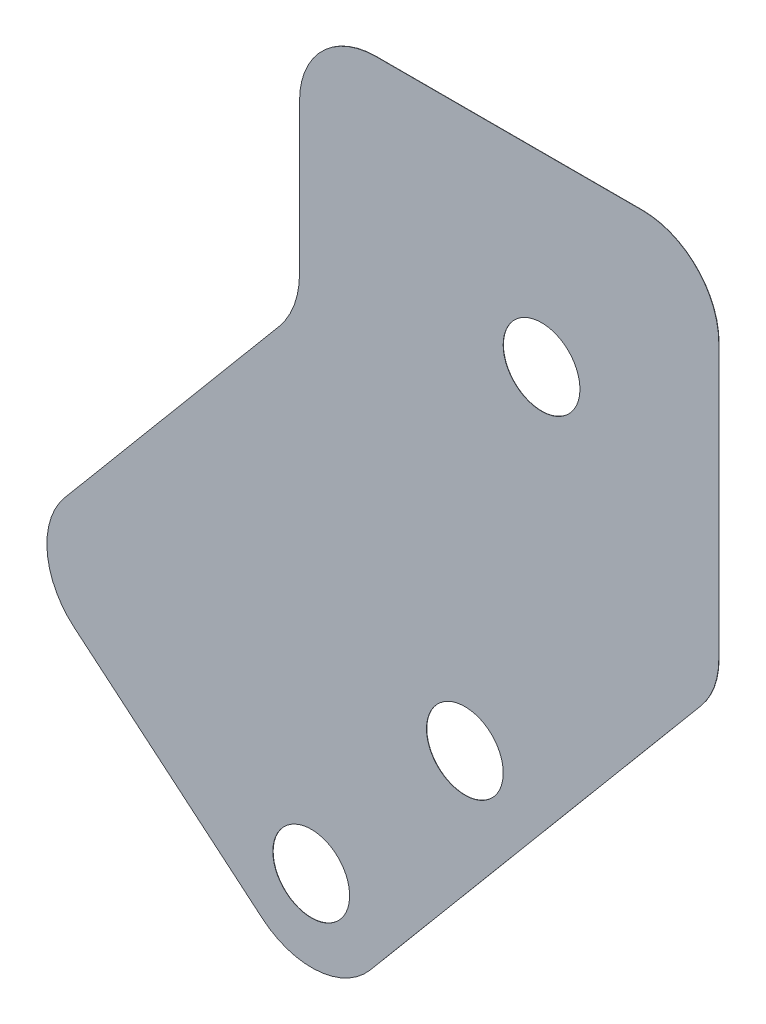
ISO-10303-21;
HEADER;
FILE_DESCRIPTION(('STEP AP214'),'2;1');
FILE_NAME('part.step','',(''),(''),'','','');
FILE_SCHEMA(('AUTOMOTIVE_DESIGN { 1 0 10303 214 1 1 1 1 }'));
ENDSEC;
DATA;
#1=APPLICATION_CONTEXT('core data for automotive mechanical design processes');
#2=APPLICATION_PROTOCOL_DEFINITION('international standard','automotive_design',2000,#1);
#3=PRODUCT_CONTEXT('',#1,'mechanical');
#4=PRODUCT('Part','Part','',(#3));
#5=PRODUCT_RELATED_PRODUCT_CATEGORY('part','',(#4));
#6=PRODUCT_DEFINITION_FORMATION('','',#4);
#7=PRODUCT_DEFINITION_CONTEXT('part definition',#1,'design');
#8=PRODUCT_DEFINITION('design','',#6,#7);
#9=PRODUCT_DEFINITION_SHAPE('','',#8);
#10=(LENGTH_UNIT() NAMED_UNIT(*) SI_UNIT(.MILLI.,.METRE.));
#11=(NAMED_UNIT(*) PLANE_ANGLE_UNIT() SI_UNIT($,.RADIAN.));
#12=(NAMED_UNIT(*) SI_UNIT($,.STERADIAN.) SOLID_ANGLE_UNIT());
#13=UNCERTAINTY_MEASURE_WITH_UNIT(LENGTH_MEASURE(1.E-05),#10,'distance_accuracy_value','');
#14=(GEOMETRIC_REPRESENTATION_CONTEXT(3) GLOBAL_UNCERTAINTY_ASSIGNED_CONTEXT((#13)) GLOBAL_UNIT_ASSIGNED_CONTEXT((#10,
#11,#12)) REPRESENTATION_CONTEXT('',''));
#15=CARTESIAN_POINT('',(0.,0.,0.));
#16=DIRECTION('',(0.,0.,1.));
#17=DIRECTION('',(1.,0.,0.));
#18=AXIS2_PLACEMENT_3D('',#15,#16,#17);
#19=CARTESIAN_POINT('',(-552.951152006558,-20.8198728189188,0.0253999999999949));
#20=DIRECTION('',(0.,0.,-1.));
#21=DIRECTION('',(-1.,0.,0.));
#22=AXIS2_PLACEMENT_3D('',#19,#20,#21);
#23=CYLINDRICAL_SURFACE('',#22,7.11199999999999);
#24=CARTESIAN_POINT('',(-552.951152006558,-20.8198728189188,0.));
#25=DIRECTION('',(0.,0.,1.));
#26=DIRECTION('',(1.,0.,0.));
#27=AXIS2_PLACEMENT_3D('',#24,#25,#26);
#28=CIRCLE('',#27,7.11199999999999);
#29=CARTESIAN_POINT('',(-545.839152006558,-20.8198728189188,0.));
#30=VERTEX_POINT('',#29);
#31=CARTESIAN_POINT('',(-552.951152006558,-13.7078728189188,0.));
#32=VERTEX_POINT('',#31);
#33=EDGE_CURVE('E171',#30,#32,#28,.T.);
#34=ORIENTED_EDGE('',*,*,#33,.T.);
#35=DIRECTION('',(0.,0.,-1.));
#36=VECTOR('',#35,1.);
#37=CARTESIAN_POINT('',(-552.951152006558,-13.7078728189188,0.0253999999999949));
#38=LINE('',#37,#36);
#39=CARTESIAN_POINT('',(-552.951152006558,-13.7078728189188,0.0253999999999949));
#40=VERTEX_POINT('',#39);
#41=EDGE_CURVE('E11',#40,#32,#38,.T.);
#42=ORIENTED_EDGE('',*,*,#41,.F.);
#43=CARTESIAN_POINT('',(-552.951152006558,-20.8198728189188,0.0253999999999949));
#44=DIRECTION('',(0.,0.,1.));
#45=DIRECTION('',(1.,0.,0.));
#46=AXIS2_PLACEMENT_3D('',#43,#44,#45);
#47=CIRCLE('',#46,7.11199999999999);
#48=CARTESIAN_POINT('',(-545.839152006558,-20.8198728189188,0.0253999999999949));
#49=VERTEX_POINT('',#48);
#50=EDGE_CURVE('E206',#49,#40,#47,.T.);
#51=ORIENTED_EDGE('',*,*,#50,.F.);
#52=DIRECTION('',(0.,0.,-1.));
#53=VECTOR('',#52,1.);
#54=CARTESIAN_POINT('',(-545.839152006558,-20.8198728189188,0.0253999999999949));
#55=LINE('',#54,#53);
#56=EDGE_CURVE('E167',#49,#30,#55,.T.);
#57=ORIENTED_EDGE('',*,*,#56,.T.);
#58=EDGE_LOOP('',(#34,#42,#51,#57));
#59=FACE_BOUND('',#58,.T.);
#60=ADVANCED_FACE('F45',(#59),#23,.T.);
#61=CARTESIAN_POINT('',(-552.951152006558,-13.7078728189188,0.0253999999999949));
#62=DIRECTION('',(0.,-1.,0.));
#63=DIRECTION('',(1.,0.,0.));
#64=AXIS2_PLACEMENT_3D('',#61,#62,#63);
#65=PLANE('',#64);
#66=DIRECTION('',(-1.,0.,0.));
#67=VECTOR('',#66,1.);
#68=CARTESIAN_POINT('',(-552.951152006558,-13.7078728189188,0.));
#69=LINE('',#68,#67);
#70=CARTESIAN_POINT('',(-577.716152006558,-13.7078728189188,0.));
#71=VERTEX_POINT('',#70);
#72=EDGE_CURVE('E175',#32,#71,#69,.T.);
#73=ORIENTED_EDGE('',*,*,#72,.T.);
#74=DIRECTION('',(0.,0.,-1.));
#75=VECTOR('',#74,1.);
#76=CARTESIAN_POINT('',(-577.716152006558,-13.7078728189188,0.0253999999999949));
#77=LINE('',#76,#75);
#78=CARTESIAN_POINT('',(-577.716152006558,-13.7078728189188,0.0253999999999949));
#79=VERTEX_POINT('',#78);
#80=EDGE_CURVE('E54',#79,#71,#77,.T.);
#81=ORIENTED_EDGE('',*,*,#80,.F.);
#82=DIRECTION('',(-1.,0.,0.));
#83=VECTOR('',#82,1.);
#84=CARTESIAN_POINT('',(-552.951152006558,-13.7078728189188,0.0253999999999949));
#85=LINE('',#84,#83);
#86=EDGE_CURVE('E117',#40,#79,#85,.T.);
#87=ORIENTED_EDGE('',*,*,#86,.F.);
#88=ORIENTED_EDGE('',*,*,#41,.T.);
#89=EDGE_LOOP('',(#73,#81,#87,#88));
#90=FACE_BOUND('',#89,.T.);
#91=ADVANCED_FACE('F308',(#90),#65,.F.);
#92=CARTESIAN_POINT('',(-577.716152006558,-20.8198728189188,0.0253999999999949));
#93=DIRECTION('',(0.,0.,-1.));
#94=DIRECTION('',(-1.,0.,0.));
#95=AXIS2_PLACEMENT_3D('',#92,#93,#94);
#96=CYLINDRICAL_SURFACE('',#95,7.112);
#97=CARTESIAN_POINT('',(-577.716152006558,-20.8198728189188,0.));
#98=DIRECTION('',(0.,0.,1.));
#99=DIRECTION('',(1.,0.,0.));
#100=AXIS2_PLACEMENT_3D('',#97,#98,#99);
#101=CIRCLE('',#100,7.112);
#102=CARTESIAN_POINT('',(-584.828152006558,-20.8198728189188,0.));
#103=VERTEX_POINT('',#102);
#104=EDGE_CURVE('E179',#71,#103,#101,.T.);
#105=ORIENTED_EDGE('',*,*,#104,.T.);
#106=DIRECTION('',(0.,0.,-1.));
#107=VECTOR('',#106,1.);
#108=CARTESIAN_POINT('',(-584.828152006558,-20.8198728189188,0.0253999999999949));
#109=LINE('',#108,#107);
#110=CARTESIAN_POINT('',(-584.828152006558,-20.8198728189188,0.0253999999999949));
#111=VERTEX_POINT('',#110);
#112=EDGE_CURVE('E233',#111,#103,#109,.T.);
#113=ORIENTED_EDGE('',*,*,#112,.F.);
#114=CARTESIAN_POINT('',(-577.716152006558,-20.8198728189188,0.0253999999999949));
#115=DIRECTION('',(0.,0.,1.));
#116=DIRECTION('',(1.,0.,0.));
#117=AXIS2_PLACEMENT_3D('',#114,#115,#116);
#118=CIRCLE('',#117,7.112);
#119=EDGE_CURVE('E244',#79,#111,#118,.T.);
#120=ORIENTED_EDGE('',*,*,#119,.F.);
#121=ORIENTED_EDGE('',*,*,#80,.T.);
#122=EDGE_LOOP('',(#105,#113,#120,#121));
#123=FACE_BOUND('',#122,.T.);
#124=ADVANCED_FACE('F242',(#123),#96,.T.);
#125=CARTESIAN_POINT('',(-584.828152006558,-20.8198728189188,0.0253999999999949));
#126=DIRECTION('',(1.,0.,0.));
#127=DIRECTION('',(0.,0.,-1.));
#128=AXIS2_PLACEMENT_3D('',#125,#126,#127);
#129=PLANE('',#128);
#130=DIRECTION('',(0.,-1.,0.));
#131=VECTOR('',#130,1.);
#132=CARTESIAN_POINT('',(-584.828152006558,-20.8198728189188,0.));
#133=LINE('',#132,#131);
#134=CARTESIAN_POINT('',(-584.828152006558,-34.722664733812,0.));
#135=VERTEX_POINT('',#134);
#136=EDGE_CURVE('E182',#103,#135,#133,.T.);
#137=ORIENTED_EDGE('',*,*,#136,.T.);
#138=DIRECTION('',(0.,0.,-1.));
#139=VECTOR('',#138,1.);
#140=CARTESIAN_POINT('',(-584.828152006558,-34.722664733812,0.0253999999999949));
#141=LINE('',#140,#139);
#142=CARTESIAN_POINT('',(-584.828152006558,-34.722664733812,0.0253999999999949));
#143=VERTEX_POINT('',#142);
#144=EDGE_CURVE('E229',#143,#135,#141,.T.);
#145=ORIENTED_EDGE('',*,*,#144,.F.);
#146=DIRECTION('',(0.,-1.,0.));
#147=VECTOR('',#146,1.);
#148=CARTESIAN_POINT('',(-584.828152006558,-20.8198728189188,0.0253999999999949));
#149=LINE('',#148,#147);
#150=EDGE_CURVE('E263',#111,#143,#149,.T.);
#151=ORIENTED_EDGE('',*,*,#150,.F.);
#152=ORIENTED_EDGE('',*,*,#112,.T.);
#153=EDGE_LOOP('',(#137,#145,#151,#152));
#154=FACE_BOUND('',#153,.T.);
#155=ADVANCED_FACE('F253',(#154),#129,.F.);
#156=CARTESIAN_POINT('',(-592.956152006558,-34.722664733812,0.0253999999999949));
#157=DIRECTION('',(0.,0.,-1.));
#158=DIRECTION('',(-1.,0.,0.));
#159=AXIS2_PLACEMENT_3D('',#156,#157,#158);
#160=CYLINDRICAL_SURFACE('',#159,8.12799999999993);
#161=CARTESIAN_POINT('',(-592.956152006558,-34.722664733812,0.));
#162=DIRECTION('',(0.,0.,-1.));
#163=DIRECTION('',(1.,0.,0.));
#164=AXIS2_PLACEMENT_3D('',#161,#162,#163);
#165=CIRCLE('',#164,8.12799999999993);
#166=CARTESIAN_POINT('',(-586.729742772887,-39.9472424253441,0.));
#167=VERTEX_POINT('',#166);
#168=EDGE_CURVE('E185',#135,#167,#165,.T.);
#169=ORIENTED_EDGE('',*,*,#168,.T.);
#170=DIRECTION('',(0.,0.,-1.));
#171=VECTOR('',#170,1.);
#172=CARTESIAN_POINT('',(-586.729742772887,-39.9472424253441,0.0253999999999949));
#173=LINE('',#172,#171);
#174=CARTESIAN_POINT('',(-586.729742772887,-39.9472424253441,0.0253999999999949));
#175=VERTEX_POINT('',#174);
#176=EDGE_CURVE('E225',#175,#167,#173,.T.);
#177=ORIENTED_EDGE('',*,*,#176,.F.);
#178=CARTESIAN_POINT('',(-592.956152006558,-34.722664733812,0.0253999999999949));
#179=DIRECTION('',(0.,0.,-1.));
#180=DIRECTION('',(1.,0.,0.));
#181=AXIS2_PLACEMENT_3D('',#178,#179,#180);
#182=CIRCLE('',#181,8.12799999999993);
#183=EDGE_CURVE('E259',#143,#175,#182,.T.);
#184=ORIENTED_EDGE('',*,*,#183,.F.);
#185=ORIENTED_EDGE('',*,*,#144,.T.);
#186=EDGE_LOOP('',(#169,#177,#184,#185));
#187=FACE_BOUND('',#186,.T.);
#188=ADVANCED_FACE('F257',(#187),#160,.F.);
#189=CARTESIAN_POINT('',(-586.729742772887,-39.9472424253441,0.0253999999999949));
#190=DIRECTION('',(0.76604444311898,-0.642787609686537,0.));
#191=DIRECTION('',(0.642787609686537,0.76604444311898,0.));
#192=AXIS2_PLACEMENT_3D('',#189,#190,#191);
#193=PLANE('',#192);
#194=DIRECTION('',(-0.642787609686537,-0.76604444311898,0.));
#195=VECTOR('',#194,1.);
#196=CARTESIAN_POINT('',(-586.729742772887,-39.9472424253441,0.));
#197=LINE('',#196,#195);
#198=CARTESIAN_POINT('',(-606.65926008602,-63.6983162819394,0.));
#199=VERTEX_POINT('',#198);
#200=EDGE_CURVE('E188',#167,#199,#197,.T.);
#201=ORIENTED_EDGE('',*,*,#200,.T.);
#202=DIRECTION('',(0.,0.,-1.));
#203=VECTOR('',#202,1.);
#204=CARTESIAN_POINT('',(-606.65926008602,-63.6983162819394,0.0253999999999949));
#205=LINE('',#204,#203);
#206=CARTESIAN_POINT('',(-606.65926008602,-63.6983162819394,0.0253999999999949));
#207=VERTEX_POINT('',#206);
#208=EDGE_CURVE('E221',#207,#199,#205,.T.);
#209=ORIENTED_EDGE('',*,*,#208,.F.);
#210=DIRECTION('',(-0.642787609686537,-0.76604444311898,0.));
#211=VECTOR('',#210,1.);
#212=CARTESIAN_POINT('',(-586.729742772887,-39.9472424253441,0.0253999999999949));
#213=LINE('',#212,#211);
#214=EDGE_CURVE('E262',#175,#207,#213,.T.);
#215=ORIENTED_EDGE('',*,*,#214,.F.);
#216=ORIENTED_EDGE('',*,*,#176,.T.);
#217=EDGE_LOOP('',(#201,#209,#215,#216));
#218=FACE_BOUND('',#217,.T.);
#219=ADVANCED_FACE('F321',(#218),#193,.F.);
#220=CARTESIAN_POINT('',(-601.211152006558,-68.26982176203,0.0253999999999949));
#221=DIRECTION('',(0.,0.,-1.));
#222=DIRECTION('',(-1.,0.,0.));
#223=AXIS2_PLACEMENT_3D('',#220,#221,#222);
#224=CYLINDRICAL_SURFACE('',#223,7.11200000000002);
#225=CARTESIAN_POINT('',(-601.211152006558,-68.26982176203,0.));
#226=DIRECTION('',(0.,0.,1.));
#227=DIRECTION('',(1.,0.,0.));
#228=AXIS2_PLACEMENT_3D('',#225,#226,#227);
#229=CIRCLE('',#228,7.11200000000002);
#230=CARTESIAN_POINT('',(-605.782657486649,-73.7179298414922,0.));
#231=VERTEX_POINT('',#230);
#232=EDGE_CURVE('E191',#199,#231,#229,.T.);
#233=ORIENTED_EDGE('',*,*,#232,.T.);
#234=DIRECTION('',(0.,0.,-1.));
#235=VECTOR('',#234,1.);
#236=CARTESIAN_POINT('',(-605.782657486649,-73.7179298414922,0.0253999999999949));
#237=LINE('',#236,#235);
#238=CARTESIAN_POINT('',(-605.782657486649,-73.7179298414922,0.0253999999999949));
#239=VERTEX_POINT('',#238);
#240=EDGE_CURVE('E217',#239,#231,#237,.T.);
#241=ORIENTED_EDGE('',*,*,#240,.F.);
#242=CARTESIAN_POINT('',(-601.211152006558,-68.26982176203,0.0253999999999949));
#243=DIRECTION('',(0.,0.,1.));
#244=DIRECTION('',(1.,0.,0.));
#245=AXIS2_PLACEMENT_3D('',#242,#243,#244);
#246=CIRCLE('',#245,7.11200000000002);
#247=EDGE_CURVE('E268',#207,#239,#246,.T.);
#248=ORIENTED_EDGE('',*,*,#247,.F.);
#249=ORIENTED_EDGE('',*,*,#208,.T.);
#250=EDGE_LOOP('',(#233,#241,#248,#249));
#251=FACE_BOUND('',#250,.T.);
#252=ADVANCED_FACE('F324',(#251),#224,.T.);
#253=CARTESIAN_POINT('',(-605.782657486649,-73.7179298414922,0.0253999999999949));
#254=DIRECTION('',(0.642787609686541,0.766044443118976,0.));
#255=DIRECTION('',(-0.766044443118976,0.642787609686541,0.));
#256=AXIS2_PLACEMENT_3D('',#253,#254,#255);
#257=PLANE('',#256);
#258=DIRECTION('',(0.766044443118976,-0.642787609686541,0.));
#259=VECTOR('',#258,1.);
#260=CARTESIAN_POINT('',(-605.782657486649,-73.7179298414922,0.));
#261=LINE('',#260,#259);
#262=CARTESIAN_POINT('',(-588.270881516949,-88.4120545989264,0.));
#263=VERTEX_POINT('',#262);
#264=EDGE_CURVE('E194',#231,#263,#261,.T.);
#265=ORIENTED_EDGE('',*,*,#264,.T.);
#266=DIRECTION('',(0.,0.,-1.));
#267=VECTOR('',#266,1.);
#268=CARTESIAN_POINT('',(-588.270881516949,-88.4120545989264,0.0253999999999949));
#269=LINE('',#268,#267);
#270=CARTESIAN_POINT('',(-588.270881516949,-88.4120545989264,0.0253999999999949));
#271=VERTEX_POINT('',#270);
#272=EDGE_CURVE('E213',#271,#263,#269,.T.);
#273=ORIENTED_EDGE('',*,*,#272,.F.);
#274=DIRECTION('',(0.766044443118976,-0.642787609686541,0.));
#275=VECTOR('',#274,1.);
#276=CARTESIAN_POINT('',(-605.782657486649,-73.7179298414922,0.0253999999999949));
#277=LINE('',#276,#275);
#278=EDGE_CURVE('E275',#239,#271,#277,.T.);
#279=ORIENTED_EDGE('',*,*,#278,.F.);
#280=ORIENTED_EDGE('',*,*,#240,.T.);
#281=EDGE_LOOP('',(#265,#273,#279,#280));
#282=FACE_BOUND('',#281,.T.);
#283=ADVANCED_FACE('F288',(#282),#257,.F.);
#284=CARTESIAN_POINT('',(-583.699376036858,-82.9639465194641,0.0253999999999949));
#285=DIRECTION('',(0.,0.,-1.));
#286=DIRECTION('',(-1.,0.,0.));
#287=AXIS2_PLACEMENT_3D('',#284,#285,#286);
#288=CYLINDRICAL_SURFACE('',#287,7.11200000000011);
#289=CARTESIAN_POINT('',(-583.699376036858,-82.9639465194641,0.));
#290=DIRECTION('',(0.,0.,1.));
#291=DIRECTION('',(1.,0.,0.));
#292=AXIS2_PLACEMENT_3D('',#289,#290,#291);
#293=CIRCLE('',#292,7.11200000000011);
#294=CARTESIAN_POINT('',(-578.251267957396,-87.5354519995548,0.));
#295=VERTEX_POINT('',#294);
#296=EDGE_CURVE('E197',#263,#295,#293,.T.);
#297=ORIENTED_EDGE('',*,*,#296,.T.);
#298=DIRECTION('',(0.,0.,-1.));
#299=VECTOR('',#298,1.);
#300=CARTESIAN_POINT('',(-578.251267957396,-87.5354519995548,0.0253999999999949));
#301=LINE('',#300,#299);
#302=CARTESIAN_POINT('',(-578.251267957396,-87.5354519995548,0.0253999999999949));
#303=VERTEX_POINT('',#302);
#304=EDGE_CURVE('E159',#303,#295,#301,.T.);
#305=ORIENTED_EDGE('',*,*,#304,.F.);
#306=CARTESIAN_POINT('',(-583.699376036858,-82.9639465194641,0.0253999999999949));
#307=DIRECTION('',(0.,0.,1.));
#308=DIRECTION('',(1.,0.,0.));
#309=AXIS2_PLACEMENT_3D('',#306,#307,#308);
#310=CIRCLE('',#309,7.11200000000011);
#311=EDGE_CURVE('E148',#271,#303,#310,.T.);
#312=ORIENTED_EDGE('',*,*,#311,.F.);
#313=ORIENTED_EDGE('',*,*,#272,.T.);
#314=EDGE_LOOP('',(#297,#305,#312,#313));
#315=FACE_BOUND('',#314,.T.);
#316=ADVANCED_FACE('F292',(#315),#288,.T.);
#317=CARTESIAN_POINT('',(-578.251267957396,-87.5354519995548,0.0253999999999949));
#318=DIRECTION('',(-0.766044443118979,0.642787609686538,0.));
#319=DIRECTION('',(-0.642787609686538,-0.766044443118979,0.));
#320=AXIS2_PLACEMENT_3D('',#317,#318,#319);
#321=PLANE('',#320);
#322=DIRECTION('',(0.642787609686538,0.766044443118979,0.));
#323=VECTOR('',#322,1.);
#324=CARTESIAN_POINT('',(-578.251267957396,-87.5354519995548,0.));
#325=LINE('',#324,#323);
#326=CARTESIAN_POINT('',(-547.503043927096,-50.8911455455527,0.));
#327=VERTEX_POINT('',#326);
#328=EDGE_CURVE('E157',#295,#327,#325,.T.);
#329=ORIENTED_EDGE('',*,*,#328,.T.);
#330=DIRECTION('',(0.,0.,-1.));
#331=VECTOR('',#330,1.);
#332=CARTESIAN_POINT('',(-547.503043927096,-50.8911455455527,0.0253999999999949));
#333=LINE('',#332,#331);
#334=CARTESIAN_POINT('',(-547.503043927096,-50.8911455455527,0.0253999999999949));
#335=VERTEX_POINT('',#334);
#336=EDGE_CURVE('E154',#335,#327,#333,.T.);
#337=ORIENTED_EDGE('',*,*,#336,.F.);
#338=DIRECTION('',(0.642787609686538,0.766044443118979,0.));
#339=VECTOR('',#338,1.);
#340=CARTESIAN_POINT('',(-578.251267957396,-87.5354519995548,0.0253999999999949));
#341=LINE('',#340,#339);
#342=EDGE_CURVE('E142',#303,#335,#341,.T.);
#343=ORIENTED_EDGE('',*,*,#342,.F.);
#344=ORIENTED_EDGE('',*,*,#304,.T.);
#345=EDGE_LOOP('',(#329,#337,#343,#344));
#346=FACE_BOUND('',#345,.T.);
#347=ADVANCED_FACE('F155',(#346),#321,.F.);
#348=CARTESIAN_POINT('',(-552.951152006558,-46.319640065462,0.0253999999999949));
#349=DIRECTION('',(0.,0.,-1.));
#350=DIRECTION('',(-1.,0.,0.));
#351=AXIS2_PLACEMENT_3D('',#348,#349,#350);
#352=CYLINDRICAL_SURFACE('',#351,7.11199999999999);
#353=CARTESIAN_POINT('',(-552.951152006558,-46.319640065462,0.));
#354=DIRECTION('',(0.,0.,1.));
#355=DIRECTION('',(1.,0.,0.));
#356=AXIS2_PLACEMENT_3D('',#353,#354,#355);
#357=CIRCLE('',#356,7.11199999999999);
#358=CARTESIAN_POINT('',(-545.839152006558,-46.319640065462,0.));
#359=VERTEX_POINT('',#358);
#360=EDGE_CURVE('E103',#327,#359,#357,.T.);
#361=ORIENTED_EDGE('',*,*,#360,.T.);
#362=DIRECTION('',(0.,0.,-1.));
#363=VECTOR('',#362,1.);
#364=CARTESIAN_POINT('',(-545.839152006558,-46.319640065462,0.0253999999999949));
#365=LINE('',#364,#363);
#366=CARTESIAN_POINT('',(-545.839152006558,-46.319640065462,0.0253999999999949));
#367=VERTEX_POINT('',#366);
#368=EDGE_CURVE('E160',#367,#359,#365,.T.);
#369=ORIENTED_EDGE('',*,*,#368,.F.);
#370=CARTESIAN_POINT('',(-552.951152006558,-46.319640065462,0.0253999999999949));
#371=DIRECTION('',(0.,0.,1.));
#372=DIRECTION('',(1.,0.,0.));
#373=AXIS2_PLACEMENT_3D('',#370,#371,#372);
#374=CIRCLE('',#373,7.11199999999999);
#375=EDGE_CURVE('E146',#335,#367,#374,.T.);
#376=ORIENTED_EDGE('',*,*,#375,.F.);
#377=ORIENTED_EDGE('',*,*,#336,.T.);
#378=EDGE_LOOP('',(#361,#369,#376,#377));
#379=FACE_BOUND('',#378,.T.);
#380=ADVANCED_FACE('F162',(#379),#352,.T.);
#381=CARTESIAN_POINT('',(-545.839152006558,-46.319640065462,0.0253999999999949));
#382=DIRECTION('',(-1.,0.,0.));
#383=DIRECTION('',(0.,0.,1.));
#384=AXIS2_PLACEMENT_3D('',#381,#382,#383);
#385=PLANE('',#384);
#386=DIRECTION('',(0.,1.,0.));
#387=VECTOR('',#386,1.);
#388=CARTESIAN_POINT('',(-545.839152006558,-46.319640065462,0.));
#389=LINE('',#388,#387);
#390=EDGE_CURVE('E109',#359,#30,#389,.T.);
#391=ORIENTED_EDGE('',*,*,#390,.T.);
#392=ORIENTED_EDGE('',*,*,#56,.F.);
#393=DIRECTION('',(0.,1.,0.));
#394=VECTOR('',#393,1.);
#395=CARTESIAN_POINT('',(-545.839152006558,-46.319640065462,0.0253999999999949));
#396=LINE('',#395,#394);
#397=EDGE_CURVE('E62',#367,#49,#396,.T.);
#398=ORIENTED_EDGE('',*,*,#397,.F.);
#399=ORIENTED_EDGE('',*,*,#368,.T.);
#400=EDGE_LOOP('',(#391,#392,#398,#399));
#401=FACE_BOUND('',#400,.T.);
#402=ADVANCED_FACE('F296',(#401),#385,.F.);
#403=CARTESIAN_POINT('',(-552.951152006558,-20.8198728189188,0.0253999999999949));
#404=DIRECTION('',(0.,0.,1.));
#405=DIRECTION('',(1.,0.,0.));
#406=AXIS2_PLACEMENT_3D('',#403,#404,#405);
#407=PLANE('',#406);
#408=CARTESIAN_POINT('',(-583.738510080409,-82.5166423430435,0.0253999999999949));
#409=DIRECTION('',(0.,0.,-1.));
#410=DIRECTION('',(-1.,0.,0.));
#411=AXIS2_PLACEMENT_3D('',#408,#409,#410);
#412=CIRCLE('',#411,3.56869999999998);
#413=CARTESIAN_POINT('',(-587.307210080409,-82.5166423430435,0.0253999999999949));
#414=VERTEX_POINT('',#413);
#415=EDGE_CURVE('E404',#414,#414,#412,.T.);
#416=ORIENTED_EDGE('',*,*,#415,.T.);
#417=EDGE_LOOP('',(#416));
#418=FACE_BOUND('',#417,.T.);
#419=CARTESIAN_POINT('',(-562.323795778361,-31.0085922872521,0.0253999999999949));
#420=DIRECTION('',(0.,0.,-1.));
#421=DIRECTION('',(-1.,0.,0.));
#422=AXIS2_PLACEMENT_3D('',#419,#420,#421);
#423=CIRCLE('',#422,3.56869999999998);
#424=CARTESIAN_POINT('',(-565.892495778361,-31.0085922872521,0.0253999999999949));
#425=VERTEX_POINT('',#424);
#426=EDGE_CURVE('E409',#425,#425,#423,.T.);
#427=ORIENTED_EDGE('',*,*,#426,.T.);
#428=EDGE_LOOP('',(#427));
#429=FACE_BOUND('',#428,.T.);
#430=CARTESIAN_POINT('',(-569.452555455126,-65.4913045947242,0.0253999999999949));
#431=DIRECTION('',(0.,0.,-1.));
#432=DIRECTION('',(-1.,0.,0.));
#433=AXIS2_PLACEMENT_3D('',#430,#431,#432);
#434=CIRCLE('',#433,3.56869999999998);
#435=CARTESIAN_POINT('',(-573.021255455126,-65.4913045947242,0.0253999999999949));
#436=VERTEX_POINT('',#435);
#437=EDGE_CURVE('E422',#436,#436,#434,.T.);
#438=ORIENTED_EDGE('',*,*,#437,.T.);
#439=EDGE_LOOP('',(#438));
#440=FACE_BOUND('',#439,.T.);
#441=ORIENTED_EDGE('',*,*,#50,.T.);
#442=ORIENTED_EDGE('',*,*,#86,.T.);
#443=ORIENTED_EDGE('',*,*,#119,.T.);
#444=ORIENTED_EDGE('',*,*,#150,.T.);
#445=ORIENTED_EDGE('',*,*,#183,.T.);
#446=ORIENTED_EDGE('',*,*,#214,.T.);
#447=ORIENTED_EDGE('',*,*,#247,.T.);
#448=ORIENTED_EDGE('',*,*,#278,.T.);
#449=ORIENTED_EDGE('',*,*,#311,.T.);
#450=ORIENTED_EDGE('',*,*,#342,.T.);
#451=ORIENTED_EDGE('',*,*,#375,.T.);
#452=ORIENTED_EDGE('',*,*,#397,.T.);
#453=EDGE_LOOP('',(#441,#442,#443,#444,#445,#446,#447,#448,#449,#450,#451,#452));
#454=FACE_BOUND('',#453,.T.);
#455=ADVANCED_FACE('F144',(#418,#429,#440,#454),#407,.T.);
#456=CARTESIAN_POINT('',(-552.951152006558,-20.8198728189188,0.));
#457=DIRECTION('',(0.,0.,1.));
#458=DIRECTION('',(1.,0.,0.));
#459=AXIS2_PLACEMENT_3D('',#456,#457,#458);
#460=PLANE('',#459);
#461=CARTESIAN_POINT('',(-583.738510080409,-82.5166423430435,0.));
#462=DIRECTION('',(0.,0.,-1.));
#463=DIRECTION('',(-1.,0.,0.));
#464=AXIS2_PLACEMENT_3D('',#461,#462,#463);
#465=CIRCLE('',#464,3.56869999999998);
#466=CARTESIAN_POINT('',(-587.307210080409,-82.5166423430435,0.));
#467=VERTEX_POINT('',#466);
#468=EDGE_CURVE('E407',#467,#467,#465,.T.);
#469=ORIENTED_EDGE('',*,*,#468,.F.);
#470=EDGE_LOOP('',(#469));
#471=FACE_BOUND('',#470,.T.);
#472=CARTESIAN_POINT('',(-562.323795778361,-31.0085922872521,0.));
#473=DIRECTION('',(0.,0.,-1.));
#474=DIRECTION('',(-1.,0.,0.));
#475=AXIS2_PLACEMENT_3D('',#472,#473,#474);
#476=CIRCLE('',#475,3.56869999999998);
#477=CARTESIAN_POINT('',(-565.892495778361,-31.0085922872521,0.));
#478=VERTEX_POINT('',#477);
#479=EDGE_CURVE('E415',#478,#478,#476,.T.);
#480=ORIENTED_EDGE('',*,*,#479,.F.);
#481=EDGE_LOOP('',(#480));
#482=FACE_BOUND('',#481,.T.);
#483=CARTESIAN_POINT('',(-569.452555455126,-65.4913045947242,0.));
#484=DIRECTION('',(0.,0.,-1.));
#485=DIRECTION('',(-1.,0.,0.));
#486=AXIS2_PLACEMENT_3D('',#483,#484,#485);
#487=CIRCLE('',#486,3.56869999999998);
#488=CARTESIAN_POINT('',(-573.021255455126,-65.4913045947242,0.));
#489=VERTEX_POINT('',#488);
#490=EDGE_CURVE('E176',#489,#489,#487,.T.);
#491=ORIENTED_EDGE('',*,*,#490,.F.);
#492=EDGE_LOOP('',(#491));
#493=FACE_BOUND('',#492,.T.);
#494=ORIENTED_EDGE('',*,*,#33,.F.);
#495=ORIENTED_EDGE('',*,*,#390,.F.);
#496=ORIENTED_EDGE('',*,*,#360,.F.);
#497=ORIENTED_EDGE('',*,*,#328,.F.);
#498=ORIENTED_EDGE('',*,*,#296,.F.);
#499=ORIENTED_EDGE('',*,*,#264,.F.);
#500=ORIENTED_EDGE('',*,*,#232,.F.);
#501=ORIENTED_EDGE('',*,*,#200,.F.);
#502=ORIENTED_EDGE('',*,*,#168,.F.);
#503=ORIENTED_EDGE('',*,*,#136,.F.);
#504=ORIENTED_EDGE('',*,*,#104,.F.);
#505=ORIENTED_EDGE('',*,*,#72,.F.);
#506=EDGE_LOOP('',(#494,#495,#496,#497,#498,#499,#500,#501,#502,#503,#504,#505));
#507=FACE_BOUND('',#506,.T.);
#508=ADVANCED_FACE('F248',(#471,#482,#493,#507),#460,.F.);
#509=CARTESIAN_POINT('',(-569.452555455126,-65.4913045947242,0.));
#510=DIRECTION('',(0.,0.,-1.));
#511=DIRECTION('',(-1.,0.,0.));
#512=AXIS2_PLACEMENT_3D('',#509,#510,#511);
#513=CYLINDRICAL_SURFACE('',#512,3.56869999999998);
#514=ORIENTED_EDGE('',*,*,#437,.F.);
#515=EDGE_LOOP('',(#514));
#516=FACE_BOUND('',#515,.T.);
#517=ORIENTED_EDGE('',*,*,#490,.T.);
#518=EDGE_LOOP('',(#517));
#519=FACE_BOUND('',#518,.T.);
#520=ADVANCED_FACE('F363',(#516,#519),#513,.F.);
#521=CARTESIAN_POINT('',(-562.323795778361,-31.0085922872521,0.));
#522=DIRECTION('',(0.,0.,-1.));
#523=DIRECTION('',(-1.,0.,0.));
#524=AXIS2_PLACEMENT_3D('',#521,#522,#523);
#525=CYLINDRICAL_SURFACE('',#524,3.56869999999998);
#526=ORIENTED_EDGE('',*,*,#426,.F.);
#527=EDGE_LOOP('',(#526));
#528=FACE_BOUND('',#527,.T.);
#529=ORIENTED_EDGE('',*,*,#479,.T.);
#530=EDGE_LOOP('',(#529));
#531=FACE_BOUND('',#530,.T.);
#532=ADVANCED_FACE('F373',(#528,#531),#525,.F.);
#533=CARTESIAN_POINT('',(-583.738510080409,-82.5166423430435,0.));
#534=DIRECTION('',(0.,0.,-1.));
#535=DIRECTION('',(-1.,0.,0.));
#536=AXIS2_PLACEMENT_3D('',#533,#534,#535);
#537=CYLINDRICAL_SURFACE('',#536,3.56869999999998);
#538=ORIENTED_EDGE('',*,*,#415,.F.);
#539=EDGE_LOOP('',(#538));
#540=FACE_BOUND('',#539,.T.);
#541=ORIENTED_EDGE('',*,*,#468,.T.);
#542=EDGE_LOOP('',(#541));
#543=FACE_BOUND('',#542,.T.);
#544=ADVANCED_FACE('F384',(#540,#543),#537,.F.);
#545=CLOSED_SHELL('',(#60,#91,#124,#155,#188,#219,#252,#283,#316,#347,#380,#402,#455,#508,#520,
#532,#544));
#546=MANIFOLD_SOLID_BREP('B2',#545);
#547=ADVANCED_BREP_SHAPE_REPRESENTATION('',(#18,#546),#14);
#548=SHAPE_DEFINITION_REPRESENTATION(#9,#547);
ENDSEC;
END-ISO-10303-21;
